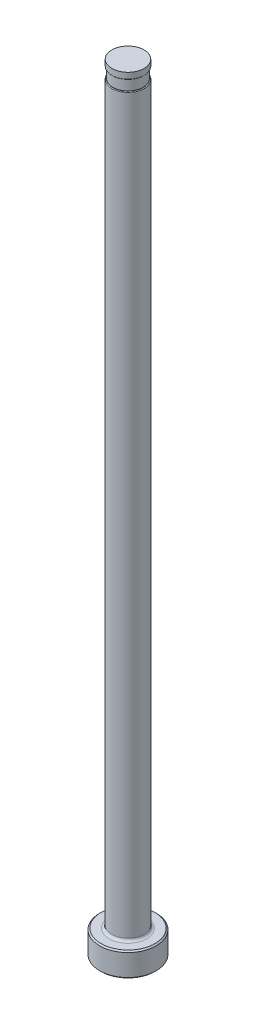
ISO-10303-21;
HEADER;
FILE_DESCRIPTION(('STEP AP214'),'2;1');
FILE_NAME('part.step','',(''),(''),'','','');
FILE_SCHEMA(('AUTOMOTIVE_DESIGN { 1 0 10303 214 1 1 1 1 }'));
ENDSEC;
DATA;
#1=APPLICATION_CONTEXT('core data for automotive mechanical design processes');
#2=APPLICATION_PROTOCOL_DEFINITION('international standard','automotive_design',2000,#1);
#3=PRODUCT_CONTEXT('',#1,'mechanical');
#4=PRODUCT('Part','Part','',(#3));
#5=PRODUCT_RELATED_PRODUCT_CATEGORY('part','',(#4));
#6=PRODUCT_DEFINITION_FORMATION('','',#4);
#7=PRODUCT_DEFINITION_CONTEXT('part definition',#1,'design');
#8=PRODUCT_DEFINITION('design','',#6,#7);
#9=PRODUCT_DEFINITION_SHAPE('','',#8);
#10=(LENGTH_UNIT() NAMED_UNIT(*) SI_UNIT(.MILLI.,.METRE.));
#11=(NAMED_UNIT(*) PLANE_ANGLE_UNIT() SI_UNIT($,.RADIAN.));
#12=(NAMED_UNIT(*) SI_UNIT($,.STERADIAN.) SOLID_ANGLE_UNIT());
#13=UNCERTAINTY_MEASURE_WITH_UNIT(LENGTH_MEASURE(1.E-05),#10,'distance_accuracy_value','');
#14=(GEOMETRIC_REPRESENTATION_CONTEXT(3) GLOBAL_UNCERTAINTY_ASSIGNED_CONTEXT((#13)) GLOBAL_UNIT_ASSIGNED_CONTEXT((#10,
#11,#12)) REPRESENTATION_CONTEXT('',''));
#15=CARTESIAN_POINT('',(0.,0.,0.));
#16=DIRECTION('',(0.,0.,1.));
#17=DIRECTION('',(1.,0.,0.));
#18=AXIS2_PLACEMENT_3D('',#15,#16,#17);
#19=CARTESIAN_POINT('',(-3.17499999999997,151.13,0.));
#20=DIRECTION('',(0.,1.,0.));
#21=DIRECTION('',(0.,0.,1.));
#22=AXIS2_PLACEMENT_3D('',#19,#20,#21);
#23=PLANE('',#22);
#24=CARTESIAN_POINT('',(0.,151.13,0.));
#25=DIRECTION('',(0.,1.,0.));
#26=DIRECTION('',(0.,0.,1.));
#27=AXIS2_PLACEMENT_3D('',#24,#25,#26);
#28=CIRCLE('',#27,3.03529999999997);
#29=CARTESIAN_POINT('',(0.,151.13,3.03529999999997));
#30=VERTEX_POINT('',#29);
#31=EDGE_CURVE('E11',#30,#30,#28,.F.);
#32=ORIENTED_EDGE('',*,*,#31,.T.);
#33=EDGE_LOOP('',(#32));
#34=FACE_BOUND('',#33,.T.);
#35=CARTESIAN_POINT('',(0.,151.13,0.));
#36=DIRECTION('',(0.,1.,0.));
#37=DIRECTION('',(0.,0.,1.));
#38=AXIS2_PLACEMENT_3D('',#35,#36,#37);
#39=CIRCLE('',#38,2.97179999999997);
#40=CARTESIAN_POINT('',(0.,151.13,2.97179999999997));
#41=VERTEX_POINT('',#40);
#42=EDGE_CURVE('E78',#41,#41,#39,.T.);
#43=ORIENTED_EDGE('',*,*,#42,.T.);
#44=EDGE_LOOP('',(#43));
#45=FACE_BOUND('',#44,.T.);
#46=ADVANCED_FACE('F36',(#34,#45),#23,.F.);
#47=CARTESIAN_POINT('',(0.,259.958771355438,0.));
#48=DIRECTION('',(0.,1.,0.));
#49=DIRECTION('',(0.,0.,1.));
#50=AXIS2_PLACEMENT_3D('',#47,#48,#49);
#51=CYLINDRICAL_SURFACE('',#50,3.17499999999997);
#52=DIRECTION('',(0.,1.,0.));
#53=VECTOR('',#52,1.);
#54=CARTESIAN_POINT('',(-2.97179999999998,259.958771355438,-1.11759999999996));
#55=LINE('',#54,#53);
#56=CARTESIAN_POINT('',(-2.97179999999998,148.971,-1.11759999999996));
#57=VERTEX_POINT('',#56);
#58=CARTESIAN_POINT('',(-2.97179999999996,86.614,-1.11760000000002));
#59=VERTEX_POINT('',#58);
#60=EDGE_CURVE('E73',#57,#59,#55,.F.);
#61=ORIENTED_EDGE('',*,*,#60,.F.);
#62=CARTESIAN_POINT('',(0.,148.971,0.));
#63=DIRECTION('',(0.,-1.,0.));
#64=DIRECTION('',(0.,0.,-1.));
#65=AXIS2_PLACEMENT_3D('',#62,#63,#64);
#66=CIRCLE('',#65,3.17499999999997);
#67=CARTESIAN_POINT('',(-2.97179999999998,148.971,1.11759999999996));
#68=VERTEX_POINT('',#67);
#69=EDGE_CURVE('E51',#57,#68,#66,.T.);
#70=ORIENTED_EDGE('',*,*,#69,.T.);
#71=DIRECTION('',(0.,1.,0.));
#72=VECTOR('',#71,1.);
#73=CARTESIAN_POINT('',(-2.97179999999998,259.958771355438,1.11759999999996));
#74=LINE('',#73,#72);
#75=CARTESIAN_POINT('',(-2.97179999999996,86.614,1.11760000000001));
#76=VERTEX_POINT('',#75);
#77=EDGE_CURVE('E84',#76,#68,#74,.T.);
#78=ORIENTED_EDGE('',*,*,#77,.F.);
#79=CARTESIAN_POINT('',(-2.97179999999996,86.614,-1.11760000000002));
#80=CARTESIAN_POINT('',(-2.97179783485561,86.5828492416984,-1.11759841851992));
#81=CARTESIAN_POINT('',(-2.97225900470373,86.5517131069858,-1.11638031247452));
#82=CARTESIAN_POINT('',(-2.97408412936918,86.4896581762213,-1.11151181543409));
#83=CARTESIAN_POINT('',(-2.9754480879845,86.4587393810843,-1.10786141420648));
#84=CARTESIAN_POINT('',(-2.98085437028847,86.3666586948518,-1.09327356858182));
#85=CARTESIAN_POINT('',(-2.98621120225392,86.3061035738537,-1.07869946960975));
#86=CARTESIAN_POINT('',(-2.99989040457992,86.1884361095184,-1.0400472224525));
#87=CARTESIAN_POINT('',(-3.0082151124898,86.131326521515,-1.01596158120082));
#88=CARTESIAN_POINT('',(-3.02694285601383,86.022241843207,-0.958720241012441));
#89=CARTESIAN_POINT('',(-3.03734492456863,85.9702643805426,-0.925568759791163));
#90=CARTESIAN_POINT('',(-3.0590244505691,85.8732383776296,-0.851164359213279));
#91=CARTESIAN_POINT('',(-3.07029576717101,85.828146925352,-0.809965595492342));
#92=CARTESIAN_POINT('',(-3.09254226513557,85.7456893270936,-0.720370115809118));
#93=CARTESIAN_POINT('',(-3.10351739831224,85.7083244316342,-0.671972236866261));
#94=CARTESIAN_POINT('',(-3.12390298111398,85.6424529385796,-0.569694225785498));
#95=CARTESIAN_POINT('',(-3.13332395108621,85.6138855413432,-0.515855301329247));
#96=CARTESIAN_POINT('',(-3.14970808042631,85.5658047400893,-0.403931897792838));
#97=CARTESIAN_POINT('',(-3.15667118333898,85.5462915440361,-0.345847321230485));
#98=CARTESIAN_POINT('',(-3.16748231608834,85.5164813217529,-0.226501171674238));
#99=CARTESIAN_POINT('',(-3.171300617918,85.5062721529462,-0.165214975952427));
#100=CARTESIAN_POINT('',(-3.17532797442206,85.4955133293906,-0.0416799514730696));
#101=CARTESIAN_POINT('',(-3.17553664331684,85.4949647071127,0.0205689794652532));
#102=CARTESIAN_POINT('',(-3.17230405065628,85.5035855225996,0.145017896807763));
#103=CARTESIAN_POINT('',(-3.16882082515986,85.5128666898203,0.207209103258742));
#104=CARTESIAN_POINT('',(-3.15849643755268,85.5412036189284,0.329033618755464));
#105=CARTESIAN_POINT('',(-3.15165544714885,85.5602588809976,0.388667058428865));
#106=CARTESIAN_POINT('',(-3.13536379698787,85.6077683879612,0.503459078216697));
#107=CARTESIAN_POINT('',(-3.12592155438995,85.6361923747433,0.558631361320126));
#108=CARTESIAN_POINT('',(-3.10544176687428,85.7018905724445,0.663093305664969));
#109=CARTESIAN_POINT('',(-3.0944044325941,85.7391636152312,0.712383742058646));
#110=CARTESIAN_POINT('',(-3.07210838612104,85.821112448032,0.803076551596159));
#111=CARTESIAN_POINT('',(-3.06085457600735,85.8656831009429,0.844575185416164));
#112=CARTESIAN_POINT('',(-3.03920760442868,85.9613924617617,0.919437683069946));
#113=CARTESIAN_POINT('',(-3.02881454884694,86.012531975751,0.95280054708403));
#114=CARTESIAN_POINT('',(-3.01003274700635,86.1197633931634,1.01056985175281));
#115=CARTESIAN_POINT('',(-3.00163816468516,86.1758402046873,1.03500248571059));
#116=CARTESIAN_POINT('',(-2.987687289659,86.2914874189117,1.0746137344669));
#117=CARTESIAN_POINT('',(-2.98212915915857,86.3510555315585,1.08979834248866));
#118=CARTESIAN_POINT('',(-2.97612776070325,86.4449133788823,1.10603958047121));
#119=CARTESIAN_POINT('',(-2.97450869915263,86.478597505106,1.11037745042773));
#120=CARTESIAN_POINT('',(-2.97234395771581,86.5461830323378,1.11615426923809));
#121=CARTESIAN_POINT('',(-2.97179623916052,86.580083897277,1.1175987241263));
#122=CARTESIAN_POINT('',(-2.97179999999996,86.614,1.11760000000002));
#123=B_SPLINE_CURVE_WITH_KNOTS('',3,(#79,#80,#81,#82,#83,#84,#85,#86,#87,#88,#89,#90,#91,#92,
#93,#94,#95,#96,#97,#98,#99,#100,#101,#102,#103,#104,#105,#106,#107,#108,#109,#110,#111,#112,
#113,#114,#115,#116,#117,#118,#119,#120,#121,#122),.UNSPECIFIED.,.F.,.F.,(4,2,2,2,2,2,2,2,2,2,2,
2,2,2,2,2,2,2,2,2,2,4),(0.,0.0933958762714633,0.186792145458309,0.373380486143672,
0.56011611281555,0.746765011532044,0.932198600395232,1.11766217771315,1.30181365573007,
1.48596936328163,1.67184654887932,1.85774359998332,2.04577654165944,2.23379986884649,
2.42122179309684,2.60861899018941,2.7935218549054,2.97844743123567,3.162826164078,
3.34708528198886,3.448962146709,3.55064495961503),.UNSPECIFIED.);
#124=EDGE_CURVE('E81',#59,#76,#123,.T.);
#125=ORIENTED_EDGE('',*,*,#124,.F.);
#126=EDGE_LOOP('',(#61,#70,#78,#125));
#127=FACE_BOUND('',#126,.T.);
#128=CARTESIAN_POINT('',(0.,5.25779999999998,0.));
#129=DIRECTION('',(0.,1.,0.));
#130=DIRECTION('',(0.,0.,1.));
#131=AXIS2_PLACEMENT_3D('',#128,#129,#130);
#132=CIRCLE('',#131,3.17499999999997);
#133=CARTESIAN_POINT('',(0.,5.25779999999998,3.17499999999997));
#134=VERTEX_POINT('',#133);
#135=EDGE_CURVE('E116',#134,#134,#132,.T.);
#136=ORIENTED_EDGE('',*,*,#135,.T.);
#137=EDGE_LOOP('',(#136));
#138=FACE_BOUND('',#137,.T.);
#139=ADVANCED_FACE('F82',(#127,#138),#51,.T.);
#140=CARTESIAN_POINT('',(0.,0.,0.));
#141=DIRECTION('',(0.,-1.,0.));
#142=DIRECTION('',(0.,0.,-1.));
#143=AXIS2_PLACEMENT_3D('',#140,#141,#142);
#144=PLANE('',#143);
#145=CARTESIAN_POINT('',(0.,0.,0.));
#146=DIRECTION('',(0.,-1.,0.));
#147=DIRECTION('',(0.,0.,-1.));
#148=AXIS2_PLACEMENT_3D('',#145,#146,#147);
#149=CIRCLE('',#148,5.29589999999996);
#150=CARTESIAN_POINT('',(0.,0.,-5.29589999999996));
#151=VERTEX_POINT('',#150);
#152=EDGE_CURVE('E113',#151,#151,#149,.T.);
#153=ORIENTED_EDGE('',*,*,#152,.T.);
#154=EDGE_LOOP('',(#153));
#155=FACE_BOUND('',#154,.T.);
#156=ADVANCED_FACE('F192',(#155),#144,.T.);
#157=CARTESIAN_POINT('',(0.,259.958771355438,0.));
#158=DIRECTION('',(0.,1.,0.));
#159=DIRECTION('',(0.,0.,1.));
#160=AXIS2_PLACEMENT_3D('',#157,#158,#159);
#161=CYLINDRICAL_SURFACE('',#160,5.54989999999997);
#162=CARTESIAN_POINT('',(0.,4.49579999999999,0.));
#163=DIRECTION('',(0.,1.,0.));
#164=DIRECTION('',(0.,0.,1.));
#165=AXIS2_PLACEMENT_3D('',#162,#163,#164);
#166=CIRCLE('',#165,5.54989999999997);
#167=CARTESIAN_POINT('',(0.,4.49579999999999,5.54989999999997));
#168=VERTEX_POINT('',#167);
#169=EDGE_CURVE('E110',#168,#168,#166,.F.);
#170=ORIENTED_EDGE('',*,*,#169,.T.);
#171=EDGE_LOOP('',(#170));
#172=FACE_BOUND('',#171,.T.);
#173=CARTESIAN_POINT('',(0.,0.253999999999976,0.));
#174=DIRECTION('',(0.,-1.,0.));
#175=DIRECTION('',(0.,0.,-1.));
#176=AXIS2_PLACEMENT_3D('',#173,#174,#175);
#177=CIRCLE('',#176,5.54989999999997);
#178=CARTESIAN_POINT('',(0.,0.253999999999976,-5.54989999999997));
#179=VERTEX_POINT('',#178);
#180=EDGE_CURVE('E107',#179,#179,#177,.F.);
#181=ORIENTED_EDGE('',*,*,#180,.T.);
#182=EDGE_LOOP('',(#181));
#183=FACE_BOUND('',#182,.T.);
#184=ADVANCED_FACE('F195',(#172,#183),#161,.T.);
#185=CARTESIAN_POINT('',(-5.54989999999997,4.7498,0.));
#186=DIRECTION('',(0.,1.,0.));
#187=DIRECTION('',(0.,0.,1.));
#188=AXIS2_PLACEMENT_3D('',#185,#186,#187);
#189=PLANE('',#188);
#190=CARTESIAN_POINT('',(0.,4.7498,0.));
#191=DIRECTION('',(0.,1.,0.));
#192=DIRECTION('',(0.,0.,1.));
#193=AXIS2_PLACEMENT_3D('',#190,#191,#192);
#194=CIRCLE('',#193,3.68299999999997);
#195=CARTESIAN_POINT('',(0.,4.7498,3.68299999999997));
#196=VERTEX_POINT('',#195);
#197=EDGE_CURVE('E87',#196,#196,#194,.F.);
#198=ORIENTED_EDGE('',*,*,#197,.T.);
#199=EDGE_LOOP('',(#198));
#200=FACE_BOUND('',#199,.T.);
#201=CARTESIAN_POINT('',(0.,4.7498,0.));
#202=DIRECTION('',(0.,1.,0.));
#203=DIRECTION('',(0.,0.,1.));
#204=AXIS2_PLACEMENT_3D('',#201,#202,#203);
#205=CIRCLE('',#204,5.29589999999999);
#206=CARTESIAN_POINT('',(0.,4.7498,5.29589999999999));
#207=VERTEX_POINT('',#206);
#208=EDGE_CURVE('E104',#207,#207,#205,.T.);
#209=ORIENTED_EDGE('',*,*,#208,.T.);
#210=EDGE_LOOP('',(#209));
#211=FACE_BOUND('',#210,.T.);
#212=ADVANCED_FACE('F190',(#200,#211),#189,.T.);
#213=CARTESIAN_POINT('',(0.,4.74980000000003,0.));
#214=DIRECTION('',(0.,-1.,0.));
#215=DIRECTION('',(0.,0.,-1.));
#216=AXIS2_PLACEMENT_3D('',#213,#214,#215);
#217=CONICAL_SURFACE('',#216,5.29589999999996,0.785398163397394);
#218=ORIENTED_EDGE('',*,*,#169,.F.);
#219=EDGE_LOOP('',(#218));
#220=FACE_BOUND('',#219,.T.);
#221=ORIENTED_EDGE('',*,*,#208,.F.);
#222=EDGE_LOOP('',(#221));
#223=FACE_BOUND('',#222,.T.);
#224=ADVANCED_FACE('F186',(#220,#223),#217,.T.);
#225=CARTESIAN_POINT('',(0.,0.253999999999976,0.));
#226=DIRECTION('',(0.,1.,0.));
#227=DIRECTION('',(0.,0.,1.));
#228=AXIS2_PLACEMENT_3D('',#225,#226,#227);
#229=CONICAL_SURFACE('',#228,5.54989999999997,0.785398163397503);
#230=ORIENTED_EDGE('',*,*,#152,.F.);
#231=EDGE_LOOP('',(#230));
#232=FACE_BOUND('',#231,.T.);
#233=ORIENTED_EDGE('',*,*,#180,.F.);
#234=EDGE_LOOP('',(#233));
#235=FACE_BOUND('',#234,.T.);
#236=ADVANCED_FACE('F182',(#232,#235),#229,.T.);
#237=CARTESIAN_POINT('',(0.,5.25779999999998,0.));
#238=DIRECTION('',(0.,1.,0.));
#239=DIRECTION('',(0.,0.,1.));
#240=AXIS2_PLACEMENT_3D('',#237,#238,#239);
#241=TOROIDAL_SURFACE('',#240,3.68299999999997,0.508);
#242=ORIENTED_EDGE('',*,*,#197,.F.);
#243=EDGE_LOOP('',(#242));
#244=FACE_BOUND('',#243,.T.);
#245=ORIENTED_EDGE('',*,*,#135,.F.);
#246=EDGE_LOOP('',(#245));
#247=FACE_BOUND('',#246,.T.);
#248=ADVANCED_FACE('F147',(#244,#247),#241,.F.);
#249=CARTESIAN_POINT('',(-3.17499999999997,149.098,0.));
#250=DIRECTION('',(0.,-1.,0.));
#251=DIRECTION('',(0.,0.,-1.));
#252=AXIS2_PLACEMENT_3D('',#249,#250,#251);
#253=PLANE('',#252);
#254=DIRECTION('',(0.,0.,1.));
#255=VECTOR('',#254,1.);
#256=CARTESIAN_POINT('',(-2.97179999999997,149.098,0.));
#257=LINE('',#256,#255);
#258=CARTESIAN_POINT('',(-2.97179999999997,149.098,0.));
#259=VERTEX_POINT('',#258);
#260=CARTESIAN_POINT('',(-2.97179999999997,149.098,0.677280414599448));
#261=VERTEX_POINT('',#260);
#262=EDGE_CURVE('E90',#259,#261,#257,.T.);
#263=ORIENTED_EDGE('',*,*,#262,.T.);
#264=CARTESIAN_POINT('',(0.,149.098,0.));
#265=DIRECTION('',(0.,-1.,0.));
#266=DIRECTION('',(0.,0.,-1.));
#267=AXIS2_PLACEMENT_3D('',#264,#265,#266);
#268=CIRCLE('',#267,3.04799999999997);
#269=CARTESIAN_POINT('',(-2.97179999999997,149.098,-0.677280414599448));
#270=VERTEX_POINT('',#269);
#271=EDGE_CURVE('E86',#261,#270,#268,.F.);
#272=ORIENTED_EDGE('',*,*,#271,.T.);
#273=EDGE_CURVE('E79',#270,#259,#257,.T.);
#274=ORIENTED_EDGE('',*,*,#273,.T.);
#275=CARTESIAN_POINT('',(0.,149.098,0.));
#276=DIRECTION('',(0.,1.,0.));
#277=DIRECTION('',(0.,0.,1.));
#278=AXIS2_PLACEMENT_3D('',#275,#276,#277);
#279=CIRCLE('',#278,2.97179999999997);
#280=EDGE_CURVE('E101',#259,#259,#279,.T.);
#281=ORIENTED_EDGE('',*,*,#280,.F.);
#282=EDGE_LOOP('',(#263,#272,#274,#281));
#283=FACE_BOUND('',#282,.T.);
#284=ADVANCED_FACE('F144',(#283),#253,.F.);
#285=CARTESIAN_POINT('',(0.,153.448281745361,0.));
#286=DIRECTION('',(0.,1.,0.));
#287=DIRECTION('',(0.,0.,1.));
#288=AXIS2_PLACEMENT_3D('',#285,#286,#287);
#289=CYLINDRICAL_SURFACE('',#288,2.97179999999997);
#290=ORIENTED_EDGE('',*,*,#42,.F.);
#291=EDGE_LOOP('',(#290));
#292=FACE_BOUND('',#291,.T.);
#293=ORIENTED_EDGE('',*,*,#280,.T.);
#294=EDGE_LOOP('',(#293));
#295=FACE_BOUND('',#294,.T.);
#296=ADVANCED_FACE('F141',(#292,#295),#289,.T.);
#297=CARTESIAN_POINT('',(-2.97179999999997,150.114,-5.54989999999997));
#298=DIRECTION('',(1.,0.,0.));
#299=DIRECTION('',(0.,1.,0.));
#300=AXIS2_PLACEMENT_3D('',#297,#298,#299);
#301=PLANE('',#300);
#302=ORIENTED_EDGE('',*,*,#273,.F.);
#303=CARTESIAN_POINT('',(-2.97179999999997,149.098,-0.677280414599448));
#304=CARTESIAN_POINT('',(-2.97179999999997,149.097991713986,-0.6984954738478));
#305=CARTESIAN_POINT('',(-2.97179999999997,149.097736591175,-0.719716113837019));
#306=CARTESIAN_POINT('',(-2.97179999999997,149.096538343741,-0.762179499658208));
#307=CARTESIAN_POINT('',(-2.97179999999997,149.095593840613,-0.783422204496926));
#308=CARTESIAN_POINT('',(-2.97179999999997,149.092820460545,-0.825863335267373));
#309=CARTESIAN_POINT('',(-2.97179999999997,149.090991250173,-0.847061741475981));
#310=CARTESIAN_POINT('',(-2.97179999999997,149.086151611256,-0.88931041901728));
#311=CARTESIAN_POINT('',(-2.97179999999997,149.083141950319,-0.91036077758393));
#312=CARTESIAN_POINT('',(-2.97179999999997,149.075222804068,-0.953695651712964));
#313=CARTESIAN_POINT('',(-2.97179999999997,149.070192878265,-0.975960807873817));
#314=CARTESIAN_POINT('',(-2.97179999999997,149.060052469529,-1.00993113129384));
#315=CARTESIAN_POINT('',(-2.97179999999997,149.055967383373,-1.02193961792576));
#316=CARTESIAN_POINT('',(-2.97179999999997,149.046509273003,-1.04542724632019));
#317=CARTESIAN_POINT('',(-2.97179999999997,149.041141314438,-1.0569082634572));
#318=CARTESIAN_POINT('',(-2.97179999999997,149.032361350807,-1.07197645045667));
#319=CARTESIAN_POINT('',(-2.97179999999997,149.029794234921,-1.07605240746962));
#320=CARTESIAN_POINT('',(-2.97179999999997,149.024297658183,-1.08396863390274));
#321=CARTESIAN_POINT('',(-2.97179999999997,149.021367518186,-1.08780844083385));
#322=CARTESIAN_POINT('',(-2.97179999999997,149.015038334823,-1.09516229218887));
#323=CARTESIAN_POINT('',(-2.97179999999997,149.01163441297,-1.09867221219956));
#324=CARTESIAN_POINT('',(-2.97179999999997,149.004296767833,-1.10509067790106));
#325=CARTESIAN_POINT('',(-2.97179999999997,149.000365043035,-1.10800139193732));
#326=CARTESIAN_POINT('',(-2.97179999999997,148.993688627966,-1.11185537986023));
#327=CARTESIAN_POINT('',(-2.97179999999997,148.991127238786,-1.11311410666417));
#328=CARTESIAN_POINT('',(-2.97179999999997,148.985839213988,-1.11520642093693));
#329=CARTESIAN_POINT('',(-2.97179999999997,148.983113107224,-1.11604129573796));
#330=CARTESIAN_POINT('',(-2.97179999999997,148.97880351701,-1.11694468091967));
#331=CARTESIAN_POINT('',(-2.97179999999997,148.977255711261,-1.11718896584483));
#332=CARTESIAN_POINT('',(-2.97179999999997,148.974139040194,-1.11751723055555));
#333=CARTESIAN_POINT('',(-2.97179999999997,148.972570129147,-1.11760077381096));
#334=CARTESIAN_POINT('',(-2.97179999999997,148.971,-1.11760000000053));
#335=B_SPLINE_CURVE_WITH_KNOTS('',3,(#303,#304,#305,#306,#307,#308,#309,#310,#311,#312,#313,
#314,#315,#316,#317,#318,#319,#320,#321,#322,#323,#324,#325,#326,#327,#328,#329,#330,#331,#332,
#333,#334),.UNSPECIFIED.,.F.,.F.,(4,2,2,2,2,2,2,2,2,2,2,2,2,2,2,4),(0.,0.063651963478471,
0.127431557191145,0.191235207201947,0.254997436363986,0.323318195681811,0.361333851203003,
0.399201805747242,0.413638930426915,0.42810348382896,0.442729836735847,0.457302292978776,
0.46583575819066,0.474343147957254,0.479036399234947,0.48374237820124),.UNSPECIFIED.);
#336=EDGE_CURVE('E59',#270,#57,#335,.T.);
#337=ORIENTED_EDGE('',*,*,#336,.T.);
#338=ORIENTED_EDGE('',*,*,#60,.T.);
#339=DIRECTION('',(0.,0.,1.));
#340=VECTOR('',#339,1.);
#341=CARTESIAN_POINT('',(-2.97179999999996,86.614,-5.54989999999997));
#342=LINE('',#341,#340);
#343=EDGE_CURVE('E77',#59,#76,#342,.T.);
#344=ORIENTED_EDGE('',*,*,#343,.T.);
#345=ORIENTED_EDGE('',*,*,#77,.T.);
#346=CARTESIAN_POINT('',(-2.97179999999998,148.971,1.11759999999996));
#347=CARTESIAN_POINT('',(-2.97179999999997,148.973844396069,1.11760835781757));
#348=CARTESIAN_POINT('',(-2.97179999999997,148.97667736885,1.11732895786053));
#349=CARTESIAN_POINT('',(-2.97179999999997,148.982214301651,1.11627315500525));
#350=CARTESIAN_POINT('',(-2.97179999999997,148.984919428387,1.11550297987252));
#351=CARTESIAN_POINT('',(-2.97179999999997,148.990802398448,1.11330388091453));
#352=CARTESIAN_POINT('',(-2.97179999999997,148.993936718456,1.1117608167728));
#353=CARTESIAN_POINT('',(-2.97179999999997,148.99992747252,1.10819062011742));
#354=CARTESIAN_POINT('',(-2.97179999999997,149.002782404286,1.10616105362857));
#355=CARTESIAN_POINT('',(-2.97179999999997,149.010003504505,1.10031059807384));
#356=CARTESIAN_POINT('',(-2.97179999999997,149.014124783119,1.09619100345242));
#357=CARTESIAN_POINT('',(-2.97179999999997,149.021733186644,1.0874137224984));
#358=CARTESIAN_POINT('',(-2.97179999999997,149.025218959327,1.08275492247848));
#359=CARTESIAN_POINT('',(-2.97179999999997,149.036988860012,1.06527198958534));
#360=CARTESIAN_POINT('',(-2.97179999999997,149.043843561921,1.0515049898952));
#361=CARTESIAN_POINT('',(-2.97179999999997,149.055670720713,1.02308851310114));
#362=CARTESIAN_POINT('',(-2.97179999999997,149.060618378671,1.00843010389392));
#363=CARTESIAN_POINT('',(-2.97179999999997,149.072630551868,0.966883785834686));
#364=CARTESIAN_POINT('',(-2.97179999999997,149.078231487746,0.939575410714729));
#365=CARTESIAN_POINT('',(-2.97179999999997,149.086982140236,0.884515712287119));
#366=CARTESIAN_POINT('',(-2.97179999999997,149.090121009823,0.8567629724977));
#367=CARTESIAN_POINT('',(-2.97179999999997,149.094504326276,0.803619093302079));
#368=CARTESIAN_POINT('',(-2.97179999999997,149.095893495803,0.778239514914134));
#369=CARTESIAN_POINT('',(-2.97179999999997,149.097627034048,0.727660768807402));
#370=CARTESIAN_POINT('',(-2.97179999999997,149.097980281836,0.702461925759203));
#371=CARTESIAN_POINT('',(-2.97179999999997,149.098,0.67728041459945));
#372=B_SPLINE_CURVE_WITH_KNOTS('',3,(#346,#347,#348,#349,#350,#351,#352,#353,#354,#355,#356,
#357,#358,#359,#360,#361,#362,#363,#364,#365,#366,#367,#368,#369,#370,#371),.UNSPECIFIED.,.F.,
.F.,(4,2,2,2,2,2,2,2,2,2,2,2,4),(0.,0.00850110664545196,0.0168964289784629,0.0273183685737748,
0.0377935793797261,0.0551763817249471,0.0725957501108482,0.118380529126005,0.164742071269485,
0.248117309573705,0.331857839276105,0.408083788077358,0.483654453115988),.UNSPECIFIED.);
#373=EDGE_CURVE('E172',#68,#261,#372,.T.);
#374=ORIENTED_EDGE('',*,*,#373,.T.);
#375=ORIENTED_EDGE('',*,*,#262,.F.);
#376=EDGE_LOOP('',(#302,#337,#338,#344,#345,#374,#375));
#377=FACE_BOUND('',#376,.T.);
#378=ADVANCED_FACE('F75',(#377),#301,.F.);
#379=CARTESIAN_POINT('',(-6.14679999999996,86.614,-5.54989999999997));
#380=DIRECTION('',(0.,0.,1.));
#381=DIRECTION('',(1.,0.,0.));
#382=AXIS2_PLACEMENT_3D('',#379,#380,#381);
#383=CYLINDRICAL_SURFACE('',#382,3.175);
#384=ORIENTED_EDGE('',*,*,#343,.F.);
#385=ORIENTED_EDGE('',*,*,#124,.T.);
#386=EDGE_LOOP('',(#384,#385));
#387=FACE_BOUND('',#386,.T.);
#388=ADVANCED_FACE('F89',(#387),#383,.F.);
#389=CARTESIAN_POINT('',(0.,152.687735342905,0.));
#390=DIRECTION('',(0.,1.,0.));
#391=DIRECTION('',(0.,0.,1.));
#392=AXIS2_PLACEMENT_3D('',#389,#390,#391);
#393=CYLINDRICAL_SURFACE('',#392,3.16229999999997);
#394=CARTESIAN_POINT('',(0.,151.257,0.));
#395=DIRECTION('',(0.,1.,0.));
#396=DIRECTION('',(0.,0.,1.));
#397=AXIS2_PLACEMENT_3D('',#394,#395,#396);
#398=CIRCLE('',#397,3.16229999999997);
#399=CARTESIAN_POINT('',(0.,151.257,3.16229999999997));
#400=VERTEX_POINT('',#399);
#401=EDGE_CURVE('E44',#400,#400,#398,.T.);
#402=ORIENTED_EDGE('',*,*,#401,.T.);
#403=EDGE_LOOP('',(#402));
#404=FACE_BOUND('',#403,.T.);
#405=CARTESIAN_POINT('',(0.,152.4,0.));
#406=DIRECTION('',(0.,1.,0.));
#407=DIRECTION('',(0.,0.,1.));
#408=AXIS2_PLACEMENT_3D('',#405,#406,#407);
#409=CIRCLE('',#408,3.16229999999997);
#410=CARTESIAN_POINT('',(0.,152.4,3.16229999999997));
#411=VERTEX_POINT('',#410);
#412=EDGE_CURVE('E91',#411,#411,#409,.T.);
#413=ORIENTED_EDGE('',*,*,#412,.F.);
#414=EDGE_LOOP('',(#413));
#415=FACE_BOUND('',#414,.T.);
#416=ADVANCED_FACE('F135',(#404,#415),#393,.T.);
#417=CARTESIAN_POINT('',(-3.17499999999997,152.4,0.));
#418=DIRECTION('',(0.,1.,0.));
#419=DIRECTION('',(0.,0.,1.));
#420=AXIS2_PLACEMENT_3D('',#417,#418,#419);
#421=PLANE('',#420);
#422=ORIENTED_EDGE('',*,*,#412,.T.);
#423=EDGE_LOOP('',(#422));
#424=FACE_BOUND('',#423,.T.);
#425=ADVANCED_FACE('F149',(#424),#421,.T.);
#426=CARTESIAN_POINT('',(0.,148.971,0.));
#427=DIRECTION('',(0.,-1.,0.));
#428=DIRECTION('',(0.,0.,-1.));
#429=AXIS2_PLACEMENT_3D('',#426,#427,#428);
#430=TOROIDAL_SURFACE('',#429,3.04799999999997,0.127);
#431=ORIENTED_EDGE('',*,*,#373,.F.);
#432=ORIENTED_EDGE('',*,*,#69,.F.);
#433=ORIENTED_EDGE('',*,*,#336,.F.);
#434=ORIENTED_EDGE('',*,*,#271,.F.);
#435=EDGE_LOOP('',(#431,#432,#433,#434));
#436=FACE_BOUND('',#435,.T.);
#437=ADVANCED_FACE('F151',(#436),#430,.T.);
#438=CARTESIAN_POINT('',(0.,151.257,0.));
#439=DIRECTION('',(0.,1.,0.));
#440=DIRECTION('',(0.,0.,1.));
#441=AXIS2_PLACEMENT_3D('',#438,#439,#440);
#442=TOROIDAL_SURFACE('',#441,3.03529999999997,0.127);
#443=ORIENTED_EDGE('',*,*,#31,.F.);
#444=EDGE_LOOP('',(#443));
#445=FACE_BOUND('',#444,.T.);
#446=ORIENTED_EDGE('',*,*,#401,.F.);
#447=EDGE_LOOP('',(#446));
#448=FACE_BOUND('',#447,.T.);
#449=ADVANCED_FACE('F38',(#445,#448),#442,.T.);
#450=CLOSED_SHELL('',(#46,#139,#156,#184,#212,#224,#236,#248,#284,#296,#378,#388,#416,#425,#437,#449));
#451=MANIFOLD_SOLID_BREP('B2',#450);
#452=ADVANCED_BREP_SHAPE_REPRESENTATION('',(#18,#451),#14);
#453=SHAPE_DEFINITION_REPRESENTATION(#9,#452);
ENDSEC;
END-ISO-10303-21;
